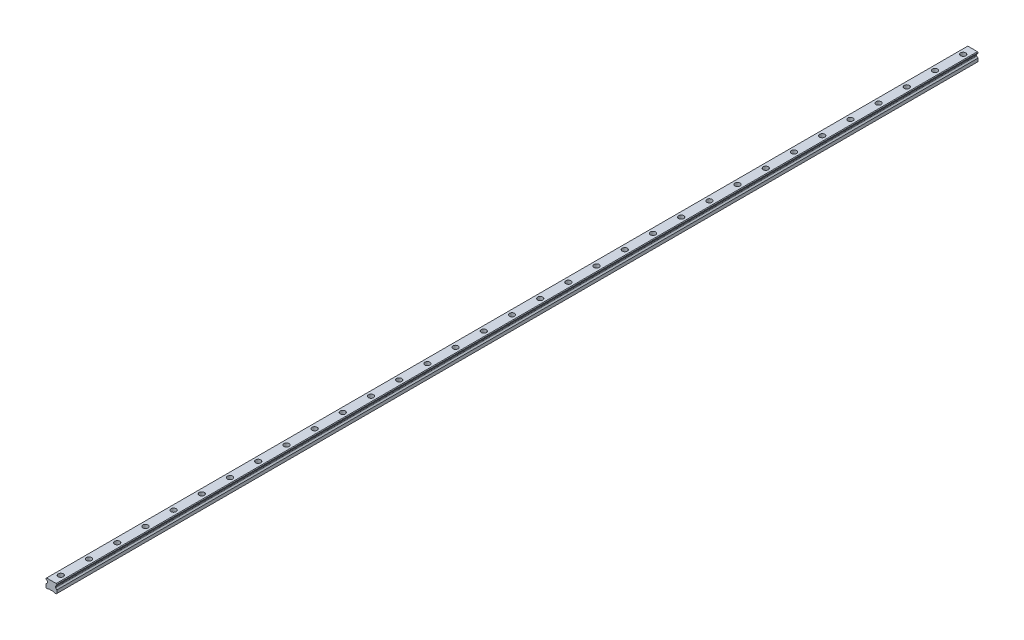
from build123d import *

# Parameters (mm, degrees)
SKETCH1_W           = 23
SKETCH1_H           = 19.2
BOSS_EXTRUDE1_DEPTH = 980
CUT_EXTRUDE1_DEPTH  = 1961.127773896
CHAMFER1_SIZE       = 1.25
FILLET1_R           = 1.25
CUT_EXTRUDE2_DEPTH  = 1961.127773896
SKETCH4_R           = 5.5
SKETCH4_R_2         = 3.5
CUT_EXTRUDE3_DEPTH  = 9
SKETCH4_2_R         = 3.5
CUT_EXTRUDE4_DEPTH  = 981.25552281
LPATTERN1_COUNT     = 33
LPATTERN1_PITCH     = 60


with BuildPart() as part:
    # Sketch1 → Boss-Extrude1 (new, symmetric)
    with BuildSketch(Plane.XY):
        with Locations((0, 9.6)):
            Rectangle(SKETCH1_W, SKETCH1_H)
    extrude(amount=BOSS_EXTRUDE1_DEPTH, both=True)

    # Sketch2 → Cut-Extrude1 (cut, through all)
    with BuildSketch(Plane.XY.offset(980)):
        Polygon((-11.5, 16.7), (-11.5, 7.95), (-8.583333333, 10.866666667), (-8.583333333, 13.783333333), align=None)
        Polygon((8.583333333, 13.783333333), (11.5, 16.7), (11.5, 7.95), (8.583333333, 10.866666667), align=None)
    extrude(amount=-CUT_EXTRUDE1_DEPTH, mode=Mode.SUBTRACT)

    # Chamfer1
    chamfer1_edges = [part.edges().sort_by_distance(p)[0] for p in [
        (-11.5, 19.2, 0),
        (11.5, 19.2, 0),
        (11.5, 0, 0),
        (-11.5, 0, 0),
    ]]
    chamfer(chamfer1_edges, length=CHAMFER1_SIZE)

    # Fillet1
    fillet1_edges = [part.edges().sort_by_distance(p)[0] for p in [
        (-8.583333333, 13.783333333, 0),
        (-8.583333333, 10.866666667, 0),
        (8.583333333, 10.866666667, 0),
        (8.583333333, 13.783333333, 0),
    ]]
    fillet(fillet1_edges, radius=FILLET1_R)

    # Sketch3 → Cut-Extrude2 (cut, through all)
    with BuildSketch(Plane.XY.offset(980)):
        Polygon((-7, 0), (-5.75, 1.25), (5.75, 1.25), (7, 0), align=None)
    extrude(amount=-CUT_EXTRUDE2_DEPTH, mode=Mode.SUBTRACT)

    # Sketch4 → Cut-Extrude3 (cut)
    with BuildSketch(Plane(origin=(0, 19.2, 0), x_dir=(1, 0, 0), z_dir=(0, 1, 0))):
        with Locations(Location((0, -960, 0), (0, 0, 270))):
            Circle(SKETCH4_R)
        with Locations(Location((0, -960, 0), (0, 0, 270))):
            Circle(SKETCH4_R_2, mode=Mode.SUBTRACT)
    cut_extrude3 = extrude(amount=-CUT_EXTRUDE3_DEPTH, mode=Mode.SUBTRACT)

    # Sketch4_2 → Cut-Extrude4 (cut, through all)
    with BuildSketch(Plane(origin=(0, 19.2, 0), x_dir=(1, 0, 0), z_dir=(0, 1, 0))):
        with Locations(Location((0, -960, 0), (0, 0, 270))):
            Circle(SKETCH4_2_R)
    cut_extrude4 = extrude(amount=-CUT_EXTRUDE4_DEPTH, mode=Mode.SUBTRACT)

    # LPattern1: Cut-Extrude3, Cut-Extrude4 ×33
    with Locations(*[(0, 0, -i * LPATTERN1_PITCH) for i in range(1, LPATTERN1_COUNT)]):
        add(cut_extrude3, mode=Mode.SUBTRACT)
        add(cut_extrude4, mode=Mode.SUBTRACT)


solid = part.part
